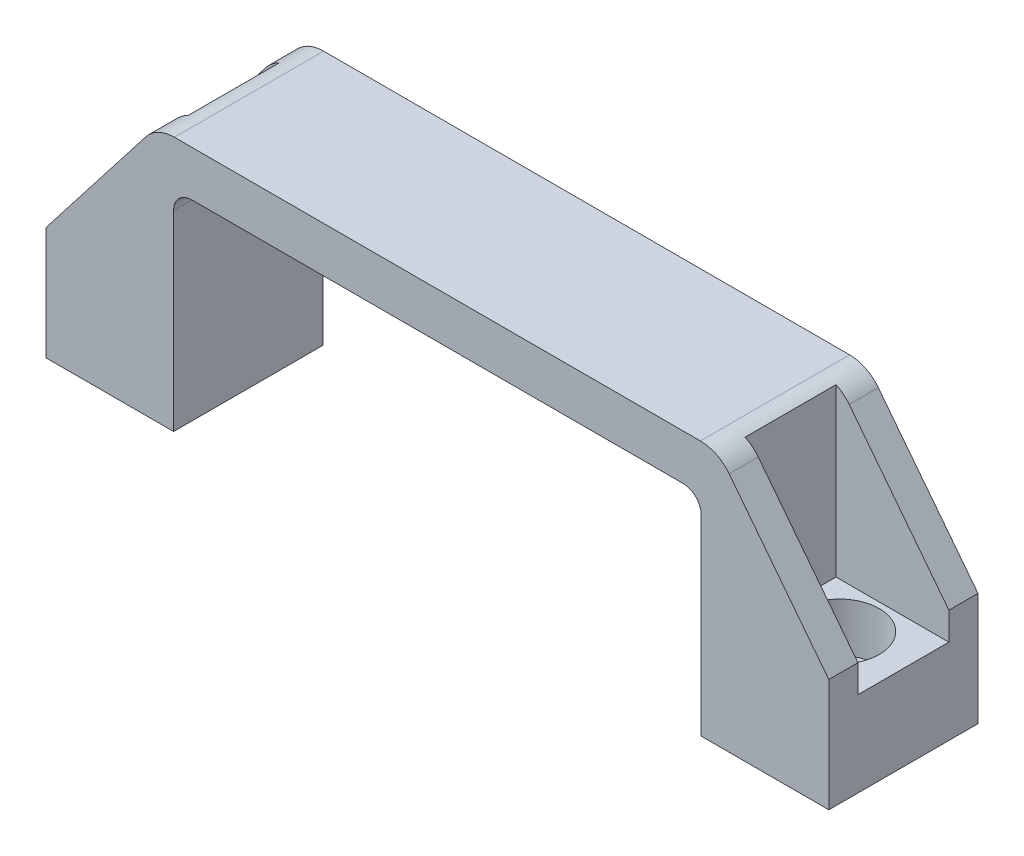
from build123d import *

# Parameters (mm, degrees)
EXTRUDE1_DEPTH                                   = 10.414
SKETCH2_W                                        = 15.75435
SKETCH2_H                                        = 12.7
CUT_EXTRUDE1_DEPTH                               = 23.749
CBORE_FOR_1_4_SOCKET_HEAD_CAP_SCREW2_D           = 6.7564
CBORE_FOR_1_4_SOCKET_HEAD_CAP_SCREW2_CBORE_D     = 11.1125
CBORE_FOR_1_4_SOCKET_HEAD_CAP_SCREW2_CBORE_DEPTH = 6.858


with BuildPart() as part:
    # Sketch1 → Extrude1 (new, symmetric)
    with BuildSketch(Plane.XY):
        with BuildLine():
            Line((0, 0), (0, 15.75435))
            Line((0, 15.75435), (13.91785606, 33.672445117))
            ThreePointArc((13.91785606, 33.672445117), (15.696396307, 35.118925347), (17.929765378, 35.6362))
            Line((17.929765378, 35.6362), (54.6481, 35.6362))
            Line((54.6481, 35.6362), (54.6481, 29.2862))
            Line((54.6481, 29.2862), (20.3581, 29.2862))
            ThreePointArc((20.3581, 29.2862), (18.562048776, 28.542251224), (17.8181, 26.7462))
            Line((17.8181, 26.7462), (17.8181, 0))
            Line((17.8181, 0), (0, 0))
        make_face()
    extrude(amount=EXTRUDE1_DEPTH, both=True)

    # Sketch2 → Cut-Extrude1 (cut)
    with BuildSketch(Plane(origin=(0, 35.6362, 0), x_dir=(-1, 0, 0), z_dir=(0, 1, 0))):
        with Locations((-7.877175, 0)):
            Rectangle(SKETCH2_W, SKETCH2_H)
    extrude(amount=-CUT_EXTRUDE1_DEPTH, mode=Mode.SUBTRACT)

    # CBORE for 1_4 Socket Head Cap Screw2 (through all)
    with Locations(Plane(origin=(0, 11.8872, 0), x_dir=(-1, 0, 0), z_dir=(0, 1, 0))):
        with Locations((-8.9281, 0)):
            CounterBoreHole(CBORE_FOR_1_4_SOCKET_HEAD_CAP_SCREW2_D / 2, CBORE_FOR_1_4_SOCKET_HEAD_CAP_SCREW2_CBORE_D / 2, CBORE_FOR_1_4_SOCKET_HEAD_CAP_SCREW2_CBORE_DEPTH)

    # Mirror1: part across plane


with BuildPart() as part_1:
    add(part.part)
    add(part.part.mirror(Plane(origin=(54.6481, 35.6362, 10.414), x_dir=(0, 0, 1), z_dir=(-1, 0, 0))))


solid = part_1.part
